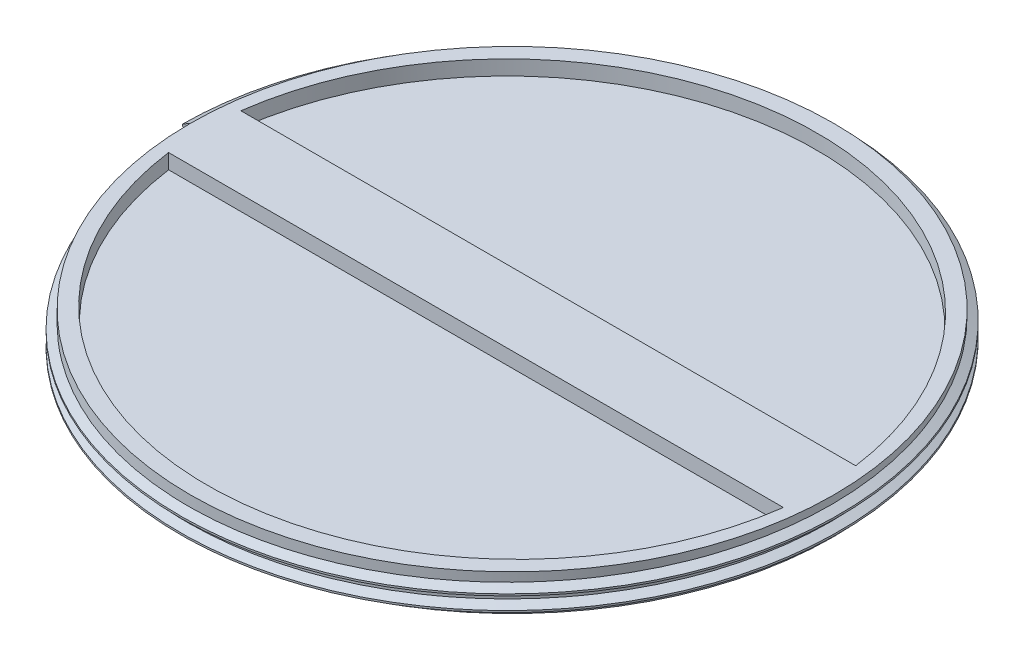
ISO-10303-21;
HEADER;
FILE_DESCRIPTION(('STEP AP214'),'2;1');
FILE_NAME('part.step','',(''),(''),'','','');
FILE_SCHEMA(('AUTOMOTIVE_DESIGN { 1 0 10303 214 1 1 1 1 }'));
ENDSEC;
DATA;
#1=APPLICATION_CONTEXT('core data for automotive mechanical design processes');
#2=APPLICATION_PROTOCOL_DEFINITION('international standard','automotive_design',2000,#1);
#3=PRODUCT_CONTEXT('',#1,'mechanical');
#4=PRODUCT('Part','Part','',(#3));
#5=PRODUCT_RELATED_PRODUCT_CATEGORY('part','',(#4));
#6=PRODUCT_DEFINITION_FORMATION('','',#4);
#7=PRODUCT_DEFINITION_CONTEXT('part definition',#1,'design');
#8=PRODUCT_DEFINITION('design','',#6,#7);
#9=PRODUCT_DEFINITION_SHAPE('','',#8);
#10=(LENGTH_UNIT() NAMED_UNIT(*) SI_UNIT(.MILLI.,.METRE.));
#11=(NAMED_UNIT(*) PLANE_ANGLE_UNIT() SI_UNIT($,.RADIAN.));
#12=(NAMED_UNIT(*) SI_UNIT($,.STERADIAN.) SOLID_ANGLE_UNIT());
#13=UNCERTAINTY_MEASURE_WITH_UNIT(LENGTH_MEASURE(1.E-05),#10,'distance_accuracy_value','');
#14=(GEOMETRIC_REPRESENTATION_CONTEXT(3) GLOBAL_UNCERTAINTY_ASSIGNED_CONTEXT((#13)) GLOBAL_UNIT_ASSIGNED_CONTEXT((#10,
#11,#12)) REPRESENTATION_CONTEXT('',''));
#15=CARTESIAN_POINT('',(0.,0.,0.));
#16=DIRECTION('',(0.,0.,1.));
#17=DIRECTION('',(1.,0.,0.));
#18=AXIS2_PLACEMENT_3D('',#15,#16,#17);
#19=CARTESIAN_POINT('',(0.,5.,0.));
#20=DIRECTION('',(0.,1.,0.));
#21=DIRECTION('',(0.,0.,1.));
#22=AXIS2_PLACEMENT_3D('',#19,#20,#21);
#23=PLANE('',#22);
#24=CARTESIAN_POINT('',(0.,5.,-0.718918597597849));
#25=DIRECTION('',(0.,1.,0.));
#26=DIRECTION('',(0.,0.,1.));
#27=AXIS2_PLACEMENT_3D('',#24,#25,#26);
#28=CIRCLE('',#27,42.8989457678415);
#29=CARTESIAN_POINT('',(-42.5160383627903,5.,5.00000000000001));
#30=VERTEX_POINT('',#29);
#31=CARTESIAN_POINT('',(42.5160383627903,5.,5.));
#32=VERTEX_POINT('',#31);
#33=EDGE_CURVE('E59',#30,#32,#28,.T.);
#34=ORIENTED_EDGE('',*,*,#33,.F.);
#35=DIRECTION('',(-1.,0.,0.));
#36=VECTOR('',#35,1.);
#37=CARTESIAN_POINT('',(42.5160383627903,5.,5.));
#38=LINE('',#37,#36);
#39=EDGE_CURVE('E170',#32,#30,#38,.T.);
#40=ORIENTED_EDGE('',*,*,#39,.F.);
#41=EDGE_LOOP('',(#34,#40));
#42=FACE_BOUND('',#41,.T.);
#43=CARTESIAN_POINT('',(0.,5.,0.));
#44=DIRECTION('',(0.,1.,0.));
#45=DIRECTION('',(0.,0.,1.));
#46=AXIS2_PLACEMENT_3D('',#43,#44,#45);
#47=CIRCLE('',#46,44.5);
#48=CARTESIAN_POINT('',(-44.5,5.,0.));
#49=VERTEX_POINT('',#48);
#50=EDGE_CURVE('E11',#49,#49,#47,.T.);
#51=ORIENTED_EDGE('',*,*,#50,.T.);
#52=EDGE_LOOP('',(#51));
#53=FACE_BOUND('',#52,.T.);
#54=DIRECTION('',(-1.,0.,0.));
#55=VECTOR('',#54,1.);
#56=CARTESIAN_POINT('',(42.5160383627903,5.,-5.));
#57=LINE('',#56,#55);
#58=CARTESIAN_POINT('',(42.5160383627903,5.,-5.));
#59=VERTEX_POINT('',#58);
#60=CARTESIAN_POINT('',(-42.5160383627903,5.,-5.00000000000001));
#61=VERTEX_POINT('',#60);
#62=EDGE_CURVE('E109',#59,#61,#57,.T.);
#63=ORIENTED_EDGE('',*,*,#62,.T.);
#64=CARTESIAN_POINT('',(0.,5.,0.718918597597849));
#65=DIRECTION('',(0.,-1.,0.));
#66=DIRECTION('',(0.,0.,-1.));
#67=AXIS2_PLACEMENT_3D('',#64,#65,#66);
#68=CIRCLE('',#67,42.8989457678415);
#69=EDGE_CURVE('E51',#61,#59,#68,.T.);
#70=ORIENTED_EDGE('',*,*,#69,.T.);
#71=EDGE_LOOP('',(#63,#70));
#72=FACE_BOUND('',#71,.T.);
#73=ADVANCED_FACE('F36',(#42,#53,#72),#23,.T.);
#74=CARTESIAN_POINT('',(0.,5.,0.));
#75=DIRECTION('',(0.,-1.,0.));
#76=DIRECTION('',(0.,0.,-1.));
#77=AXIS2_PLACEMENT_3D('',#74,#75,#76);
#78=CYLINDRICAL_SURFACE('',#77,44.5);
#79=CARTESIAN_POINT('',(0.,0.,0.));
#80=DIRECTION('',(0.,1.,0.));
#81=DIRECTION('',(0.,0.,1.));
#82=AXIS2_PLACEMENT_3D('',#79,#80,#81);
#83=CIRCLE('',#82,44.5);
#84=CARTESIAN_POINT('',(-7.51145031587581E-07,0.,44.5));
#85=VERTEX_POINT('',#84);
#86=CARTESIAN_POINT('',(-44.5,0.,0.));
#87=VERTEX_POINT('',#86);
#88=EDGE_CURVE('E40',#85,#87,#83,.T.);
#89=ORIENTED_EDGE('',*,*,#88,.T.);
#90=DIRECTION('',(0.,-1.,0.));
#91=VECTOR('',#90,1.);
#92=CARTESIAN_POINT('',(-44.5,0.250000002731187,0.));
#93=LINE('',#92,#91);
#94=CARTESIAN_POINT('',(-44.5,1.,0.));
#95=VERTEX_POINT('',#94);
#96=EDGE_CURVE('E223',#95,#87,#93,.T.);
#97=ORIENTED_EDGE('',*,*,#96,.F.);
#98=CARTESIAN_POINT('',(-44.5,5.,0.));
#99=CARTESIAN_POINT('',(-44.5,4.9,-14.4589264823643));
#100=CARTESIAN_POINT('',(-36.0012562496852,4.8,-26.1564437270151));
#101=CARTESIAN_POINT('',(-27.5025124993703,4.7,-37.8539609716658));
#102=CARTESIAN_POINT('',(-13.7512562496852,4.6,-42.3220149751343));
#103=CARTESIAN_POINT('',(0.,4.5,-46.7900689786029));
#104=CARTESIAN_POINT('',(13.7512562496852,4.4,-42.3220149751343));
#105=CARTESIAN_POINT('',(27.5025124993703,4.3,-37.8539609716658));
#106=CARTESIAN_POINT('',(36.0012562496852,4.2,-26.1564437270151));
#107=CARTESIAN_POINT('',(44.5,4.1,-14.4589264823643));
#108=CARTESIAN_POINT('',(44.5,4.,0.));
#109=CARTESIAN_POINT('',(44.5,3.9,14.4589264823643));
#110=CARTESIAN_POINT('',(36.0012562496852,3.8,26.1564437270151));
#111=CARTESIAN_POINT('',(27.5025124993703,3.7,37.8539609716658));
#112=CARTESIAN_POINT('',(13.7512562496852,3.6,42.3220149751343));
#113=CARTESIAN_POINT('',(0.,3.5,46.7900689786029));
#114=CARTESIAN_POINT('',(-13.7512562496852,3.4,42.3220149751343));
#115=CARTESIAN_POINT('',(-27.5025124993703,3.3,37.8539609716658));
#116=CARTESIAN_POINT('',(-36.0012562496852,3.2,26.1564437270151));
#117=CARTESIAN_POINT('',(-44.5,3.1,14.4589264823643));
#118=CARTESIAN_POINT('',(-44.5,3.,0.));
#119=CARTESIAN_POINT('',(-44.5,2.9,-14.4589264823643));
#120=CARTESIAN_POINT('',(-36.0012562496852,2.8,-26.1564437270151));
#121=CARTESIAN_POINT('',(-27.5025124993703,2.7,-37.8539609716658));
#122=CARTESIAN_POINT('',(-13.7512562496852,2.6,-42.3220149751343));
#123=CARTESIAN_POINT('',(0.,2.5,-46.7900689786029));
#124=CARTESIAN_POINT('',(13.7512562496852,2.4,-42.3220149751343));
#125=CARTESIAN_POINT('',(27.5025124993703,2.3,-37.8539609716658));
#126=CARTESIAN_POINT('',(36.0012562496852,2.2,-26.1564437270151));
#127=CARTESIAN_POINT('',(44.5,2.1,-14.4589264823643));
#128=CARTESIAN_POINT('',(44.5,2.,0.));
#129=CARTESIAN_POINT('',(44.5,1.9,14.4589264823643));
#130=CARTESIAN_POINT('',(36.0012562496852,1.8,26.1564437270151));
#131=CARTESIAN_POINT('',(27.5025124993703,1.7,37.8539609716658));
#132=CARTESIAN_POINT('',(13.7512562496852,1.6,42.3220149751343));
#133=CARTESIAN_POINT('',(0.,1.5,46.7900689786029));
#134=CARTESIAN_POINT('',(-13.7512562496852,1.4,42.3220149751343));
#135=CARTESIAN_POINT('',(-27.5025124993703,1.3,37.8539609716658));
#136=CARTESIAN_POINT('',(-36.0012562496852,1.2,26.1564437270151));
#137=CARTESIAN_POINT('',(-44.5,1.1,14.4589264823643));
#138=CARTESIAN_POINT('',(-44.5,1.,0.));
#139=(BOUNDED_CURVE() B_SPLINE_CURVE(2,(#98,#99,#100,#101,#102,#103,#104,#105,#106,#107,#108,
#109,#110,#111,#112,#113,#114,#115,#116,#117,#118,#119,#120,#121,#122,#123,#124,#125,#126,#127,
#128,#129,#130,#131,#132,#133,#134,#135,#136,#137,#138),.UNSPECIFIED.,.F.,
.F.) B_SPLINE_CURVE_WITH_KNOTS((3,2,2,2,2,2,2,2,2,2,2,2,2,2,2,2,2,2,2,2,3),(0.,0.05,0.1,0.15,
0.2,0.25,0.3,0.35,0.4,0.45,0.5,0.55,0.6,0.65,0.7,0.75,0.8,0.85,0.9,0.95,1.),
.UNSPECIFIED.) CURVE() GEOMETRIC_REPRESENTATION_ITEM() RATIONAL_B_SPLINE_CURVE((1.,
0.951056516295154,1.,0.951056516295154,1.,0.951056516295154,1.,0.951056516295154,1.,
0.951056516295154,1.,0.951056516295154,1.,0.951056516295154,1.,0.951056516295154,1.,
0.951056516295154,1.,0.951056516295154,1.,0.951056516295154,1.,0.951056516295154,1.,
0.951056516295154,1.,0.951056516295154,1.,0.951056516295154,1.,0.951056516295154,1.,
0.951056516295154,1.,0.951056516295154,1.,0.951056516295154,1.,0.951056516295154,1.)) REPRESENTATION_ITEM(''));
#140=EDGE_CURVE('E189',#49,#95,#139,.T.);
#141=ORIENTED_EDGE('',*,*,#140,.F.);
#142=ORIENTED_EDGE('',*,*,#50,.F.);
#143=DIRECTION('',(0.,1.,0.));
#144=VECTOR('',#143,1.);
#145=CARTESIAN_POINT('',(-44.5,4.25000000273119,0.));
#146=LINE('',#145,#144);
#147=CARTESIAN_POINT('',(-44.5,3.50000000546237,0.));
#148=VERTEX_POINT('',#147);
#149=EDGE_CURVE('E188',#148,#49,#146,.T.);
#150=ORIENTED_EDGE('',*,*,#149,.F.);
#151=CARTESIAN_POINT('',(-44.5,3.50000000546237,0.));
#152=CARTESIAN_POINT('',(-44.5,3.40000000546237,-14.4589264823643));
#153=CARTESIAN_POINT('',(-36.0012562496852,3.30000000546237,-26.1564437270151));
#154=CARTESIAN_POINT('',(-27.5025124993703,3.20000000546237,-37.8539609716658));
#155=CARTESIAN_POINT('',(-13.7512562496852,3.10000000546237,-42.3220149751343));
#156=CARTESIAN_POINT('',(0.,3.00000000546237,-46.7900689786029));
#157=CARTESIAN_POINT('',(13.7512562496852,2.90000000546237,-42.3220149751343));
#158=CARTESIAN_POINT('',(27.5025124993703,2.80000000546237,-37.8539609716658));
#159=CARTESIAN_POINT('',(36.0012562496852,2.70000000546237,-26.1564437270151));
#160=CARTESIAN_POINT('',(44.5,2.60000000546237,-14.4589264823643));
#161=CARTESIAN_POINT('',(44.5,2.50000000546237,0.));
#162=CARTESIAN_POINT('',(44.5,2.40000000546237,14.4589264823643));
#163=CARTESIAN_POINT('',(36.0012562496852,2.30000000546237,26.1564437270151));
#164=CARTESIAN_POINT('',(27.5025124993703,2.20000000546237,37.8539609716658));
#165=CARTESIAN_POINT('',(13.7512562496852,2.10000000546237,42.3220149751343));
#166=CARTESIAN_POINT('',(0.,2.00000000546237,46.7900689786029));
#167=CARTESIAN_POINT('',(-13.7512562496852,1.90000000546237,42.3220149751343));
#168=CARTESIAN_POINT('',(-27.5025124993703,1.80000000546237,37.8539609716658));
#169=CARTESIAN_POINT('',(-36.0012562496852,1.70000000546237,26.1564437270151));
#170=CARTESIAN_POINT('',(-44.5,1.60000000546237,14.4589264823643));
#171=CARTESIAN_POINT('',(-44.5,1.50000000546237,0.));
#172=CARTESIAN_POINT('',(-44.5,1.40000000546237,-14.4589264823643));
#173=CARTESIAN_POINT('',(-36.0012562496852,1.30000000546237,-26.1564437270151));
#174=CARTESIAN_POINT('',(-27.5025124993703,1.20000000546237,-37.8539609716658));
#175=CARTESIAN_POINT('',(-13.7512562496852,1.10000000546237,-42.3220149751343));
#176=CARTESIAN_POINT('',(0.,1.00000000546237,-46.7900689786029));
#177=CARTESIAN_POINT('',(13.7512562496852,0.900000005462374,-42.3220149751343));
#178=CARTESIAN_POINT('',(27.5025124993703,0.800000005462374,-37.8539609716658));
#179=CARTESIAN_POINT('',(36.0012562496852,0.700000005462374,-26.1564437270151));
#180=CARTESIAN_POINT('',(44.5,0.600000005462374,-14.4589264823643));
#181=CARTESIAN_POINT('',(44.5,0.500000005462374,0.));
#182=CARTESIAN_POINT('',(44.5,0.400000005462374,14.4589264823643));
#183=CARTESIAN_POINT('',(36.0012562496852,0.300000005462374,26.1564437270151));
#184=CARTESIAN_POINT('',(27.5025124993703,0.200000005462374,37.8539609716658));
#185=CARTESIAN_POINT('',(13.7512562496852,0.100000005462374,42.3220149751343));
#186=CARTESIAN_POINT('',(0.,5.46237404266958E-09,46.7900689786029));
#187=CARTESIAN_POINT('',(-13.7512562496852,-0.0999999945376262,42.3220149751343));
#188=CARTESIAN_POINT('',(-27.5025124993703,-0.199999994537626,37.8539609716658));
#189=CARTESIAN_POINT('',(-36.0012562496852,-0.299999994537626,26.1564437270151));
#190=CARTESIAN_POINT('',(-44.5,-0.399999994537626,14.4589264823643));
#191=CARTESIAN_POINT('',(-44.5,-0.499999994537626,0.));
#192=(BOUNDED_CURVE() B_SPLINE_CURVE(2,(#151,#152,#153,#154,#155,#156,#157,#158,#159,#160,#161,
#162,#163,#164,#165,#166,#167,#168,#169,#170,#171,#172,#173,#174,#175,#176,#177,#178,#179,#180,
#181,#182,#183,#184,#185,#186,#187,#188,#189,#190,#191),.UNSPECIFIED.,.F.,
.F.) B_SPLINE_CURVE_WITH_KNOTS((3,2,2,2,2,2,2,2,2,2,2,2,2,2,2,2,2,2,2,2,3),(0.,0.05,0.1,0.15,
0.2,0.25,0.3,0.35,0.4,0.45,0.5,0.55,0.6,0.65,0.7,0.75,0.8,0.85,0.9,0.95,1.),
.UNSPECIFIED.) CURVE() GEOMETRIC_REPRESENTATION_ITEM() RATIONAL_B_SPLINE_CURVE((1.,
0.951056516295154,1.,0.951056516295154,1.,0.951056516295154,1.,0.951056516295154,1.,
0.951056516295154,1.,0.951056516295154,1.,0.951056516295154,1.,0.951056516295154,1.,
0.951056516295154,1.,0.951056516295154,1.,0.951056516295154,1.,0.951056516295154,1.,
0.951056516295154,1.,0.951056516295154,1.,0.951056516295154,1.,0.951056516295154,1.,
0.951056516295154,1.,0.951056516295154,1.,0.951056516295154,1.,0.951056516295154,1.)) REPRESENTATION_ITEM(''));
#193=EDGE_CURVE('E173',#148,#85,#192,.T.);
#194=ORIENTED_EDGE('',*,*,#193,.T.);
#195=EDGE_LOOP('',(#89,#97,#141,#142,#150,#194));
#196=FACE_BOUND('',#195,.T.);
#197=ADVANCED_FACE('F38',(#196),#78,.T.);
#198=CARTESIAN_POINT('',(0.,0.,0.));
#199=DIRECTION('',(0.,1.,0.));
#200=DIRECTION('',(0.,0.,1.));
#201=AXIS2_PLACEMENT_3D('',#198,#199,#200);
#202=PLANE('',#201);
#203=ORIENTED_EDGE('',*,*,#88,.F.);
#204=EDGE_CURVE('E216',#87,#85,#83,.T.);
#205=ORIENTED_EDGE('',*,*,#204,.F.);
#206=EDGE_LOOP('',(#203,#205));
#207=FACE_BOUND('',#206,.T.);
#208=ADVANCED_FACE('F256',(#207),#202,.F.);
#209=CARTESIAN_POINT('',(0.,5.,0.));
#210=DIRECTION('',(0.,-1.,0.));
#211=DIRECTION('',(0.,0.,-1.));
#212=AXIS2_PLACEMENT_3D('',#209,#210,#211);
#213=CYLINDRICAL_SURFACE('',#212,44.5);
#214=ORIENTED_EDGE('',*,*,#204,.T.);
#215=CARTESIAN_POINT('',(-44.5,-0.499999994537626,0.));
#216=VERTEX_POINT('',#215);
#217=EDGE_CURVE('E179',#85,#216,#192,.T.);
#218=ORIENTED_EDGE('',*,*,#217,.T.);
#219=EDGE_CURVE('E198',#87,#216,#93,.T.);
#220=ORIENTED_EDGE('',*,*,#219,.F.);
#221=EDGE_LOOP('',(#214,#218,#220));
#222=FACE_BOUND('',#221,.T.);
#223=ADVANCED_FACE('F259',(#222),#213,.F.);
#224=CARTESIAN_POINT('',(-45.58253175,4.25000000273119,0.));
#225=DIRECTION('',(0.,0.,1.));
#226=DIRECTION('',(1.,0.,0.));
#227=AXIS2_PLACEMENT_3D('',#224,#225,#226);
#228=PLANE('',#227);
#229=DIRECTION('',(0.,-1.,0.));
#230=VECTOR('',#229,1.);
#231=CARTESIAN_POINT('',(-45.58253175,4.25000000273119,0.));
#232=LINE('',#231,#230);
#233=CARTESIAN_POINT('',(-45.58253175,4.37500000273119,0.));
#234=VERTEX_POINT('',#233);
#235=CARTESIAN_POINT('',(-45.58253175,4.12500000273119,0.));
#236=VERTEX_POINT('',#235);
#237=EDGE_CURVE('E217',#234,#236,#232,.T.);
#238=ORIENTED_EDGE('',*,*,#237,.T.);
#239=DIRECTION('',(0.866025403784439,-0.499999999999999,0.));
#240=VECTOR('',#239,1.);
#241=CARTESIAN_POINT('',(-45.041265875,3.81250000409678,0.));
#242=LINE('',#241,#240);
#243=EDGE_CURVE('E230',#236,#148,#242,.T.);
#244=ORIENTED_EDGE('',*,*,#243,.T.);
#245=ORIENTED_EDGE('',*,*,#149,.T.);
#246=DIRECTION('',(-0.866025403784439,-0.499999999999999,0.));
#247=VECTOR('',#246,1.);
#248=CARTESIAN_POINT('',(-45.041265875,4.68750000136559,0.));
#249=LINE('',#248,#247);
#250=EDGE_CURVE('E208',#49,#234,#249,.T.);
#251=ORIENTED_EDGE('',*,*,#250,.T.);
#252=EDGE_LOOP('',(#238,#244,#245,#251));
#253=FACE_BOUND('',#252,.T.);
#254=ADVANCED_FACE('F266',(#253),#228,.T.);
#255=CARTESIAN_POINT('',(-45.58253175,0.250000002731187,0.));
#256=DIRECTION('',(0.,0.,-1.));
#257=DIRECTION('',(-1.,0.,0.));
#258=AXIS2_PLACEMENT_3D('',#255,#256,#257);
#259=PLANE('',#258);
#260=DIRECTION('',(0.,1.,0.));
#261=VECTOR('',#260,1.);
#262=CARTESIAN_POINT('',(-45.58253175,0.250000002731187,0.));
#263=LINE('',#262,#261);
#264=CARTESIAN_POINT('',(-45.58253175,0.125000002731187,0.));
#265=VERTEX_POINT('',#264);
#266=CARTESIAN_POINT('',(-45.58253175,0.375000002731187,0.));
#267=VERTEX_POINT('',#266);
#268=EDGE_CURVE('E209',#265,#267,#263,.T.);
#269=ORIENTED_EDGE('',*,*,#268,.T.);
#270=DIRECTION('',(0.866025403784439,0.499999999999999,0.));
#271=VECTOR('',#270,1.);
#272=CARTESIAN_POINT('',(-45.041265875,0.687500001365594,0.));
#273=LINE('',#272,#271);
#274=EDGE_CURVE('E207',#267,#95,#273,.T.);
#275=ORIENTED_EDGE('',*,*,#274,.T.);
#276=ORIENTED_EDGE('',*,*,#96,.T.);
#277=ORIENTED_EDGE('',*,*,#219,.T.);
#278=DIRECTION('',(-0.866025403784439,0.499999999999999,0.));
#279=VECTOR('',#278,1.);
#280=CARTESIAN_POINT('',(-45.041265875,-0.18749999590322,0.));
#281=LINE('',#280,#279);
#282=EDGE_CURVE('E228',#216,#265,#281,.T.);
#283=ORIENTED_EDGE('',*,*,#282,.T.);
#284=EDGE_LOOP('',(#269,#275,#276,#277,#283));
#285=FACE_BOUND('',#284,.T.);
#286=ADVANCED_FACE('F280',(#285),#259,.T.);
#287=CARTESIAN_POINT('',(-45.58253175,4.37500000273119,0.));
#288=CARTESIAN_POINT('',(-45.58253175,4.27500000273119,-14.8106623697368));
#289=CARTESIAN_POINT('',(-36.8770428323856,4.17500000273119,-26.7927399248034));
#290=CARTESIAN_POINT('',(-28.1715539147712,4.07500000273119,-38.77481747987));
#291=CARTESIAN_POINT('',(-14.0857769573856,3.97500000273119,-43.3515638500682));
#292=CARTESIAN_POINT('',(0.,3.87500000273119,-47.9283102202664));
#293=CARTESIAN_POINT('',(14.0857769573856,3.77500000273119,-43.3515638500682));
#294=CARTESIAN_POINT('',(28.1715539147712,3.67500000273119,-38.77481747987));
#295=CARTESIAN_POINT('',(36.8770428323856,3.57500000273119,-26.7927399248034));
#296=CARTESIAN_POINT('',(45.58253175,3.47500000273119,-14.8106623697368));
#297=CARTESIAN_POINT('',(45.58253175,3.37500000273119,0.));
#298=CARTESIAN_POINT('',(45.58253175,3.27500000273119,14.8106623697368));
#299=CARTESIAN_POINT('',(36.8770428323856,3.17500000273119,26.7927399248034));
#300=CARTESIAN_POINT('',(28.1715539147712,3.07500000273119,38.77481747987));
#301=CARTESIAN_POINT('',(14.0857769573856,2.97500000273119,43.3515638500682));
#302=CARTESIAN_POINT('',(0.,2.87500000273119,47.9283102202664));
#303=CARTESIAN_POINT('',(-14.0857769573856,2.77500000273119,43.3515638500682));
#304=CARTESIAN_POINT('',(-28.1715539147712,2.67500000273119,38.77481747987));
#305=CARTESIAN_POINT('',(-36.8770428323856,2.57500000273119,26.7927399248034));
#306=CARTESIAN_POINT('',(-45.58253175,2.47500000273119,14.8106623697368));
#307=CARTESIAN_POINT('',(-45.58253175,2.37500000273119,0.));
#308=CARTESIAN_POINT('',(-45.58253175,2.27500000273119,-14.8106623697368));
#309=CARTESIAN_POINT('',(-36.8770428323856,2.17500000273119,-26.7927399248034));
#310=CARTESIAN_POINT('',(-28.1715539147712,2.07500000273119,-38.77481747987));
#311=CARTESIAN_POINT('',(-14.0857769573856,1.97500000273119,-43.3515638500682));
#312=CARTESIAN_POINT('',(0.,1.87500000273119,-47.9283102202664));
#313=CARTESIAN_POINT('',(14.0857769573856,1.77500000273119,-43.3515638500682));
#314=CARTESIAN_POINT('',(28.1715539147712,1.67500000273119,-38.77481747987));
#315=CARTESIAN_POINT('',(36.8770428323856,1.57500000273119,-26.7927399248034));
#316=CARTESIAN_POINT('',(45.58253175,1.47500000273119,-14.8106623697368));
#317=CARTESIAN_POINT('',(45.58253175,1.37500000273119,0.));
#318=CARTESIAN_POINT('',(45.58253175,1.27500000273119,14.8106623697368));
#319=CARTESIAN_POINT('',(36.8770428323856,1.17500000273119,26.7927399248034));
#320=CARTESIAN_POINT('',(28.1715539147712,1.07500000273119,38.77481747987));
#321=CARTESIAN_POINT('',(14.0857769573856,0.975000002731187,43.3515638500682));
#322=CARTESIAN_POINT('',(0.,0.875000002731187,47.9283102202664));
#323=CARTESIAN_POINT('',(-14.0857769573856,0.775000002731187,43.3515638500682));
#324=CARTESIAN_POINT('',(-28.1715539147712,0.675000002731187,38.77481747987));
#325=CARTESIAN_POINT('',(-36.8770428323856,0.575000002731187,26.7927399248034));
#326=CARTESIAN_POINT('',(-45.58253175,0.475000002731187,14.8106623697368));
#327=CARTESIAN_POINT('',(-45.58253175,0.375000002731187,0.));
#328=CARTESIAN_POINT('',(-45.58253175,4.12500000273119,0.));
#329=CARTESIAN_POINT('',(-45.58253175,4.02500000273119,-14.8106623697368));
#330=CARTESIAN_POINT('',(-36.8770428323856,3.92500000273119,-26.7927399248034));
#331=CARTESIAN_POINT('',(-28.1715539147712,3.82500000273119,-38.77481747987));
#332=CARTESIAN_POINT('',(-14.0857769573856,3.72500000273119,-43.3515638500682));
#333=CARTESIAN_POINT('',(0.,3.62500000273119,-47.9283102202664));
#334=CARTESIAN_POINT('',(14.0857769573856,3.52500000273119,-43.3515638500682));
#335=CARTESIAN_POINT('',(28.1715539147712,3.42500000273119,-38.77481747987));
#336=CARTESIAN_POINT('',(36.8770428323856,3.32500000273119,-26.7927399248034));
#337=CARTESIAN_POINT('',(45.58253175,3.22500000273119,-14.8106623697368));
#338=CARTESIAN_POINT('',(45.58253175,3.12500000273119,0.));
#339=CARTESIAN_POINT('',(45.58253175,3.02500000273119,14.8106623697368));
#340=CARTESIAN_POINT('',(36.8770428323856,2.92500000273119,26.7927399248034));
#341=CARTESIAN_POINT('',(28.1715539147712,2.82500000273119,38.77481747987));
#342=CARTESIAN_POINT('',(14.0857769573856,2.72500000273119,43.3515638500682));
#343=CARTESIAN_POINT('',(0.,2.62500000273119,47.9283102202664));
#344=CARTESIAN_POINT('',(-14.0857769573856,2.52500000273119,43.3515638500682));
#345=CARTESIAN_POINT('',(-28.1715539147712,2.42500000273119,38.77481747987));
#346=CARTESIAN_POINT('',(-36.8770428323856,2.32500000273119,26.7927399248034));
#347=CARTESIAN_POINT('',(-45.58253175,2.22500000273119,14.8106623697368));
#348=CARTESIAN_POINT('',(-45.58253175,2.12500000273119,0.));
#349=CARTESIAN_POINT('',(-45.58253175,2.02500000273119,-14.8106623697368));
#350=CARTESIAN_POINT('',(-36.8770428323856,1.92500000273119,-26.7927399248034));
#351=CARTESIAN_POINT('',(-28.1715539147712,1.82500000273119,-38.77481747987));
#352=CARTESIAN_POINT('',(-14.0857769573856,1.72500000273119,-43.3515638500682));
#353=CARTESIAN_POINT('',(0.,1.62500000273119,-47.9283102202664));
#354=CARTESIAN_POINT('',(14.0857769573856,1.52500000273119,-43.3515638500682));
#355=CARTESIAN_POINT('',(28.1715539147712,1.42500000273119,-38.77481747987));
#356=CARTESIAN_POINT('',(36.8770428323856,1.32500000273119,-26.7927399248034));
#357=CARTESIAN_POINT('',(45.58253175,1.22500000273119,-14.8106623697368));
#358=CARTESIAN_POINT('',(45.58253175,1.12500000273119,0.));
#359=CARTESIAN_POINT('',(45.58253175,1.02500000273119,14.8106623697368));
#360=CARTESIAN_POINT('',(36.8770428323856,0.925000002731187,26.7927399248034));
#361=CARTESIAN_POINT('',(28.1715539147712,0.825000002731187,38.77481747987));
#362=CARTESIAN_POINT('',(14.0857769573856,0.725000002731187,43.3515638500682));
#363=CARTESIAN_POINT('',(0.,0.625000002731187,47.9283102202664));
#364=CARTESIAN_POINT('',(-14.0857769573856,0.525000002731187,43.3515638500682));
#365=CARTESIAN_POINT('',(-28.1715539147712,0.425000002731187,38.77481747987));
#366=CARTESIAN_POINT('',(-36.8770428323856,0.325000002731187,26.7927399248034));
#367=CARTESIAN_POINT('',(-45.58253175,0.225000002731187,14.8106623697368));
#368=CARTESIAN_POINT('',(-45.58253175,0.125000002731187,0.));
#369=(BOUNDED_SURFACE() B_SPLINE_SURFACE(1,2,((#287,#288,#289,#290,#291,#292,#293,#294,#295,
#296,#297,#298,#299,#300,#301,#302,#303,#304,#305,#306,#307,#308,#309,#310,#311,#312,#313,#314,
#315,#316,#317,#318,#319,#320,#321,#322,#323,#324,#325,#326,#327),(#328,#329,#330,#331,#332,
#333,#334,#335,#336,#337,#338,#339,#340,#341,#342,#343,#344,#345,#346,#347,#348,#349,#350,#351,
#352,#353,#354,#355,#356,#357,#358,#359,#360,#361,#362,#363,#364,#365,#366,#367,#368)),
.UNSPECIFIED.,.F.,.F.,.F.) B_SPLINE_SURFACE_WITH_KNOTS((2,2),(3,2,2,2,2,2,2,2,2,2,2,2,2,2,2,2,2,
2,2,2,3),(0.,1.),(0.,0.05,0.1,0.15,0.2,0.25,0.3,0.35,0.4,0.45,0.5,0.55,0.6,0.65,0.7,0.75,0.8,
0.85,0.9,0.95,1.),.UNSPECIFIED.) GEOMETRIC_REPRESENTATION_ITEM() RATIONAL_B_SPLINE_SURFACE(((1.,
0.951056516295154,1.,0.951056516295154,1.,0.951056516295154,1.,0.951056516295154,1.,
0.951056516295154,1.,0.951056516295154,1.,0.951056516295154,1.,0.951056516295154,1.,
0.951056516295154,1.,0.951056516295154,1.,0.951056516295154,1.,0.951056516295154,1.,
0.951056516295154,1.,0.951056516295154,1.,0.951056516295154,1.,0.951056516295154,1.,
0.951056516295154,1.,0.951056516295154,1.,0.951056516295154,1.,0.951056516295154,1.),(1.,
0.951056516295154,1.,0.951056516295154,1.,0.951056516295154,1.,0.951056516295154,1.,
0.951056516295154,1.,0.951056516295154,1.,0.951056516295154,1.,0.951056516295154,1.,
0.951056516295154,1.,0.951056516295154,1.,0.951056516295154,1.,0.951056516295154,1.,
0.951056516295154,1.,0.951056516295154,1.,0.951056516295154,1.,0.951056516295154,1.,
0.951056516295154,1.,0.951056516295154,1.,0.951056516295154,1.,0.951056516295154,1.))) REPRESENTATION_ITEM('') SURFACE());
#370=CARTESIAN_POINT('',(-45.58253175,4.37500000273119,0.));
#371=CARTESIAN_POINT('',(-45.58253175,4.27500000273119,-14.8106623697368));
#372=CARTESIAN_POINT('',(-36.8770428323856,4.17500000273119,-26.7927399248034));
#373=CARTESIAN_POINT('',(-28.1715539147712,4.07500000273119,-38.77481747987));
#374=CARTESIAN_POINT('',(-14.0857769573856,3.97500000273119,-43.3515638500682));
#375=CARTESIAN_POINT('',(0.,3.87500000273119,-47.9283102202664));
#376=CARTESIAN_POINT('',(14.0857769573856,3.77500000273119,-43.3515638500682));
#377=CARTESIAN_POINT('',(28.1715539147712,3.67500000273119,-38.77481747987));
#378=CARTESIAN_POINT('',(36.8770428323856,3.57500000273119,-26.7927399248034));
#379=CARTESIAN_POINT('',(45.58253175,3.47500000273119,-14.8106623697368));
#380=CARTESIAN_POINT('',(45.58253175,3.37500000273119,0.));
#381=CARTESIAN_POINT('',(45.58253175,3.27500000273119,14.8106623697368));
#382=CARTESIAN_POINT('',(36.8770428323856,3.17500000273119,26.7927399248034));
#383=CARTESIAN_POINT('',(28.1715539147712,3.07500000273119,38.77481747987));
#384=CARTESIAN_POINT('',(14.0857769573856,2.97500000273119,43.3515638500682));
#385=CARTESIAN_POINT('',(0.,2.87500000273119,47.9283102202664));
#386=CARTESIAN_POINT('',(-14.0857769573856,2.77500000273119,43.3515638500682));
#387=CARTESIAN_POINT('',(-28.1715539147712,2.67500000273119,38.77481747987));
#388=CARTESIAN_POINT('',(-36.8770428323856,2.57500000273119,26.7927399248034));
#389=CARTESIAN_POINT('',(-45.58253175,2.47500000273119,14.8106623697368));
#390=CARTESIAN_POINT('',(-45.58253175,2.37500000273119,0.));
#391=CARTESIAN_POINT('',(-45.58253175,2.27500000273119,-14.8106623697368));
#392=CARTESIAN_POINT('',(-36.8770428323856,2.17500000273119,-26.7927399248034));
#393=CARTESIAN_POINT('',(-28.1715539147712,2.07500000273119,-38.77481747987));
#394=CARTESIAN_POINT('',(-14.0857769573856,1.97500000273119,-43.3515638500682));
#395=CARTESIAN_POINT('',(0.,1.87500000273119,-47.9283102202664));
#396=CARTESIAN_POINT('',(14.0857769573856,1.77500000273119,-43.3515638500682));
#397=CARTESIAN_POINT('',(28.1715539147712,1.67500000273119,-38.77481747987));
#398=CARTESIAN_POINT('',(36.8770428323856,1.57500000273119,-26.7927399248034));
#399=CARTESIAN_POINT('',(45.58253175,1.47500000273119,-14.8106623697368));
#400=CARTESIAN_POINT('',(45.58253175,1.37500000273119,0.));
#401=CARTESIAN_POINT('',(45.58253175,1.27500000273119,14.8106623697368));
#402=CARTESIAN_POINT('',(36.8770428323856,1.17500000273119,26.7927399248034));
#403=CARTESIAN_POINT('',(28.1715539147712,1.07500000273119,38.77481747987));
#404=CARTESIAN_POINT('',(14.0857769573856,0.975000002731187,43.3515638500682));
#405=CARTESIAN_POINT('',(0.,0.875000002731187,47.9283102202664));
#406=CARTESIAN_POINT('',(-14.0857769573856,0.775000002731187,43.3515638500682));
#407=CARTESIAN_POINT('',(-28.1715539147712,0.675000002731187,38.77481747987));
#408=CARTESIAN_POINT('',(-36.8770428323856,0.575000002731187,26.7927399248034));
#409=CARTESIAN_POINT('',(-45.58253175,0.475000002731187,14.8106623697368));
#410=CARTESIAN_POINT('',(-45.58253175,0.375000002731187,0.));
#411=(BOUNDED_CURVE() B_SPLINE_CURVE(2,(#370,#371,#372,#373,#374,#375,#376,#377,#378,#379,#380,
#381,#382,#383,#384,#385,#386,#387,#388,#389,#390,#391,#392,#393,#394,#395,#396,#397,#398,#399,
#400,#401,#402,#403,#404,#405,#406,#407,#408,#409,#410),.UNSPECIFIED.,.F.,
.F.) B_SPLINE_CURVE_WITH_KNOTS((3,2,2,2,2,2,2,2,2,2,2,2,2,2,2,2,2,2,2,2,3),(0.,0.05,0.1,0.15,
0.2,0.25,0.3,0.35,0.4,0.45,0.5,0.55,0.6,0.65,0.7,0.75,0.8,0.85,0.9,0.95,1.),
.UNSPECIFIED.) CURVE() GEOMETRIC_REPRESENTATION_ITEM() RATIONAL_B_SPLINE_CURVE((1.,
0.951056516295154,1.,0.951056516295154,1.,0.951056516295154,1.,0.951056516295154,1.,
0.951056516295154,1.,0.951056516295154,1.,0.951056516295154,1.,0.951056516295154,1.,
0.951056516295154,1.,0.951056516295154,1.,0.951056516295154,1.,0.951056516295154,1.,
0.951056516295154,1.,0.951056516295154,1.,0.951056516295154,1.,0.951056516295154,1.,
0.951056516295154,1.,0.951056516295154,1.,0.951056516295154,1.,0.951056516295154,1.)) REPRESENTATION_ITEM(''));
#412=EDGE_CURVE('E199',#234,#267,#411,.T.);
#413=CARTESIAN_POINT('',(-45.58253175,4.12500000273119,0.));
#414=CARTESIAN_POINT('',(-45.58253175,4.02500000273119,-14.8106623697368));
#415=CARTESIAN_POINT('',(-36.8770428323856,3.92500000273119,-26.7927399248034));
#416=CARTESIAN_POINT('',(-28.1715539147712,3.82500000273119,-38.77481747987));
#417=CARTESIAN_POINT('',(-14.0857769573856,3.72500000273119,-43.3515638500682));
#418=CARTESIAN_POINT('',(0.,3.62500000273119,-47.9283102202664));
#419=CARTESIAN_POINT('',(14.0857769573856,3.52500000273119,-43.3515638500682));
#420=CARTESIAN_POINT('',(28.1715539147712,3.42500000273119,-38.77481747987));
#421=CARTESIAN_POINT('',(36.8770428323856,3.32500000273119,-26.7927399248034));
#422=CARTESIAN_POINT('',(45.58253175,3.22500000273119,-14.8106623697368));
#423=CARTESIAN_POINT('',(45.58253175,3.12500000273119,0.));
#424=CARTESIAN_POINT('',(45.58253175,3.02500000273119,14.8106623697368));
#425=CARTESIAN_POINT('',(36.8770428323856,2.92500000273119,26.7927399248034));
#426=CARTESIAN_POINT('',(28.1715539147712,2.82500000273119,38.77481747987));
#427=CARTESIAN_POINT('',(14.0857769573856,2.72500000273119,43.3515638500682));
#428=CARTESIAN_POINT('',(0.,2.62500000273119,47.9283102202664));
#429=CARTESIAN_POINT('',(-14.0857769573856,2.52500000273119,43.3515638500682));
#430=CARTESIAN_POINT('',(-28.1715539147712,2.42500000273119,38.77481747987));
#431=CARTESIAN_POINT('',(-36.8770428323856,2.32500000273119,26.7927399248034));
#432=CARTESIAN_POINT('',(-45.58253175,2.22500000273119,14.8106623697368));
#433=CARTESIAN_POINT('',(-45.58253175,2.12500000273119,0.));
#434=CARTESIAN_POINT('',(-45.58253175,2.02500000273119,-14.8106623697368));
#435=CARTESIAN_POINT('',(-36.8770428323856,1.92500000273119,-26.7927399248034));
#436=CARTESIAN_POINT('',(-28.1715539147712,1.82500000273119,-38.77481747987));
#437=CARTESIAN_POINT('',(-14.0857769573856,1.72500000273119,-43.3515638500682));
#438=CARTESIAN_POINT('',(0.,1.62500000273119,-47.9283102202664));
#439=CARTESIAN_POINT('',(14.0857769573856,1.52500000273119,-43.3515638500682));
#440=CARTESIAN_POINT('',(28.1715539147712,1.42500000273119,-38.77481747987));
#441=CARTESIAN_POINT('',(36.8770428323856,1.32500000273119,-26.7927399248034));
#442=CARTESIAN_POINT('',(45.58253175,1.22500000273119,-14.8106623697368));
#443=CARTESIAN_POINT('',(45.58253175,1.12500000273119,0.));
#444=CARTESIAN_POINT('',(45.58253175,1.02500000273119,14.8106623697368));
#445=CARTESIAN_POINT('',(36.8770428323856,0.925000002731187,26.7927399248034));
#446=CARTESIAN_POINT('',(28.1715539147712,0.825000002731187,38.77481747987));
#447=CARTESIAN_POINT('',(14.0857769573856,0.725000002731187,43.3515638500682));
#448=CARTESIAN_POINT('',(0.,0.625000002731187,47.9283102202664));
#449=CARTESIAN_POINT('',(-14.0857769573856,0.525000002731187,43.3515638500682));
#450=CARTESIAN_POINT('',(-28.1715539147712,0.425000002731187,38.77481747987));
#451=CARTESIAN_POINT('',(-36.8770428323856,0.325000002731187,26.7927399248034));
#452=CARTESIAN_POINT('',(-45.58253175,0.225000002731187,14.8106623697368));
#453=CARTESIAN_POINT('',(-45.58253175,0.125000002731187,0.));
#454=(BOUNDED_CURVE() B_SPLINE_CURVE(2,(#413,#414,#415,#416,#417,#418,#419,#420,#421,#422,#423,
#424,#425,#426,#427,#428,#429,#430,#431,#432,#433,#434,#435,#436,#437,#438,#439,#440,#441,#442,
#443,#444,#445,#446,#447,#448,#449,#450,#451,#452,#453),.UNSPECIFIED.,.F.,
.F.) B_SPLINE_CURVE_WITH_KNOTS((3,2,2,2,2,2,2,2,2,2,2,2,2,2,2,2,2,2,2,2,3),(0.,0.05,0.1,0.15,
0.2,0.25,0.3,0.35,0.4,0.45,0.5,0.55,0.6,0.65,0.7,0.75,0.8,0.85,0.9,0.95,1.),
.UNSPECIFIED.) CURVE() GEOMETRIC_REPRESENTATION_ITEM() RATIONAL_B_SPLINE_CURVE((1.,
0.951056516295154,1.,0.951056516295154,1.,0.951056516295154,1.,0.951056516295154,1.,
0.951056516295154,1.,0.951056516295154,1.,0.951056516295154,1.,0.951056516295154,1.,
0.951056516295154,1.,0.951056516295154,1.,0.951056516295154,1.,0.951056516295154,1.,
0.951056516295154,1.,0.951056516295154,1.,0.951056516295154,1.,0.951056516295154,1.,
0.951056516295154,1.,0.951056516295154,1.,0.951056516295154,1.,0.951056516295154,1.)) REPRESENTATION_ITEM(''));
#455=EDGE_CURVE('E178',#236,#265,#454,.T.);
#456=ORIENTED_EDGE('',*,*,#237,.F.);
#457=ORIENTED_EDGE('',*,*,#412,.T.);
#458=ORIENTED_EDGE('',*,*,#268,.F.);
#459=ORIENTED_EDGE('',*,*,#455,.F.);
#460=EDGE_LOOP('',(#456,#457,#458,#459));
#461=FACE_BOUND('',#460,.T.);
#462=ADVANCED_FACE('F288',(#461),#369,.F.);
#463=CARTESIAN_POINT('',(-44.5,5.,0.));
#464=CARTESIAN_POINT('',(-44.5,4.9,-14.4589264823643));
#465=CARTESIAN_POINT('',(-36.0012562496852,4.8,-26.1564437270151));
#466=CARTESIAN_POINT('',(-27.5025124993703,4.7,-37.8539609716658));
#467=CARTESIAN_POINT('',(-13.7512562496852,4.6,-42.3220149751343));
#468=CARTESIAN_POINT('',(0.,4.5,-46.7900689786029));
#469=CARTESIAN_POINT('',(13.7512562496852,4.4,-42.3220149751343));
#470=CARTESIAN_POINT('',(27.5025124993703,4.3,-37.8539609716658));
#471=CARTESIAN_POINT('',(36.0012562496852,4.2,-26.1564437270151));
#472=CARTESIAN_POINT('',(44.5,4.1,-14.4589264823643));
#473=CARTESIAN_POINT('',(44.5,4.,0.));
#474=CARTESIAN_POINT('',(44.5,3.9,14.4589264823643));
#475=CARTESIAN_POINT('',(36.0012562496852,3.8,26.1564437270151));
#476=CARTESIAN_POINT('',(27.5025124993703,3.7,37.8539609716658));
#477=CARTESIAN_POINT('',(13.7512562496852,3.6,42.3220149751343));
#478=CARTESIAN_POINT('',(0.,3.5,46.7900689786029));
#479=CARTESIAN_POINT('',(-13.7512562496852,3.4,42.3220149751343));
#480=CARTESIAN_POINT('',(-27.5025124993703,3.3,37.8539609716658));
#481=CARTESIAN_POINT('',(-36.0012562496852,3.2,26.1564437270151));
#482=CARTESIAN_POINT('',(-44.5,3.1,14.4589264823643));
#483=CARTESIAN_POINT('',(-44.5,3.,0.));
#484=CARTESIAN_POINT('',(-44.5,2.9,-14.4589264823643));
#485=CARTESIAN_POINT('',(-36.0012562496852,2.8,-26.1564437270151));
#486=CARTESIAN_POINT('',(-27.5025124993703,2.7,-37.8539609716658));
#487=CARTESIAN_POINT('',(-13.7512562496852,2.6,-42.3220149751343));
#488=CARTESIAN_POINT('',(0.,2.5,-46.7900689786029));
#489=CARTESIAN_POINT('',(13.7512562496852,2.4,-42.3220149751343));
#490=CARTESIAN_POINT('',(27.5025124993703,2.3,-37.8539609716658));
#491=CARTESIAN_POINT('',(36.0012562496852,2.2,-26.1564437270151));
#492=CARTESIAN_POINT('',(44.5,2.1,-14.4589264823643));
#493=CARTESIAN_POINT('',(44.5,2.,0.));
#494=CARTESIAN_POINT('',(44.5,1.9,14.4589264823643));
#495=CARTESIAN_POINT('',(36.0012562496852,1.8,26.1564437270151));
#496=CARTESIAN_POINT('',(27.5025124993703,1.7,37.8539609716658));
#497=CARTESIAN_POINT('',(13.7512562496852,1.6,42.3220149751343));
#498=CARTESIAN_POINT('',(0.,1.5,46.7900689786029));
#499=CARTESIAN_POINT('',(-13.7512562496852,1.4,42.3220149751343));
#500=CARTESIAN_POINT('',(-27.5025124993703,1.3,37.8539609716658));
#501=CARTESIAN_POINT('',(-36.0012562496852,1.2,26.1564437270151));
#502=CARTESIAN_POINT('',(-44.5,1.1,14.4589264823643));
#503=CARTESIAN_POINT('',(-44.5,1.,0.));
#504=CARTESIAN_POINT('',(-45.58253175,4.37500000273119,0.));
#505=CARTESIAN_POINT('',(-45.58253175,4.27500000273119,-14.8106623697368));
#506=CARTESIAN_POINT('',(-36.8770428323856,4.17500000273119,-26.7927399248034));
#507=CARTESIAN_POINT('',(-28.1715539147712,4.07500000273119,-38.77481747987));
#508=CARTESIAN_POINT('',(-14.0857769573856,3.97500000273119,-43.3515638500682));
#509=CARTESIAN_POINT('',(0.,3.87500000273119,-47.9283102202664));
#510=CARTESIAN_POINT('',(14.0857769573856,3.77500000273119,-43.3515638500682));
#511=CARTESIAN_POINT('',(28.1715539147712,3.67500000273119,-38.77481747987));
#512=CARTESIAN_POINT('',(36.8770428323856,3.57500000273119,-26.7927399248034));
#513=CARTESIAN_POINT('',(45.58253175,3.47500000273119,-14.8106623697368));
#514=CARTESIAN_POINT('',(45.58253175,3.37500000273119,0.));
#515=CARTESIAN_POINT('',(45.58253175,3.27500000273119,14.8106623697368));
#516=CARTESIAN_POINT('',(36.8770428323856,3.17500000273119,26.7927399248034));
#517=CARTESIAN_POINT('',(28.1715539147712,3.07500000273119,38.77481747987));
#518=CARTESIAN_POINT('',(14.0857769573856,2.97500000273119,43.3515638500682));
#519=CARTESIAN_POINT('',(0.,2.87500000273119,47.9283102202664));
#520=CARTESIAN_POINT('',(-14.0857769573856,2.77500000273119,43.3515638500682));
#521=CARTESIAN_POINT('',(-28.1715539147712,2.67500000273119,38.77481747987));
#522=CARTESIAN_POINT('',(-36.8770428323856,2.57500000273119,26.7927399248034));
#523=CARTESIAN_POINT('',(-45.58253175,2.47500000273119,14.8106623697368));
#524=CARTESIAN_POINT('',(-45.58253175,2.37500000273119,0.));
#525=CARTESIAN_POINT('',(-45.58253175,2.27500000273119,-14.8106623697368));
#526=CARTESIAN_POINT('',(-36.8770428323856,2.17500000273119,-26.7927399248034));
#527=CARTESIAN_POINT('',(-28.1715539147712,2.07500000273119,-38.77481747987));
#528=CARTESIAN_POINT('',(-14.0857769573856,1.97500000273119,-43.3515638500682));
#529=CARTESIAN_POINT('',(0.,1.87500000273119,-47.9283102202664));
#530=CARTESIAN_POINT('',(14.0857769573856,1.77500000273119,-43.3515638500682));
#531=CARTESIAN_POINT('',(28.1715539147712,1.67500000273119,-38.77481747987));
#532=CARTESIAN_POINT('',(36.8770428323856,1.57500000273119,-26.7927399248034));
#533=CARTESIAN_POINT('',(45.58253175,1.47500000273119,-14.8106623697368));
#534=CARTESIAN_POINT('',(45.58253175,1.37500000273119,0.));
#535=CARTESIAN_POINT('',(45.58253175,1.27500000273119,14.8106623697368));
#536=CARTESIAN_POINT('',(36.8770428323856,1.17500000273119,26.7927399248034));
#537=CARTESIAN_POINT('',(28.1715539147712,1.07500000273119,38.77481747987));
#538=CARTESIAN_POINT('',(14.0857769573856,0.975000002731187,43.3515638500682));
#539=CARTESIAN_POINT('',(0.,0.875000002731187,47.9283102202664));
#540=CARTESIAN_POINT('',(-14.0857769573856,0.775000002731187,43.3515638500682));
#541=CARTESIAN_POINT('',(-28.1715539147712,0.675000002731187,38.77481747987));
#542=CARTESIAN_POINT('',(-36.8770428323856,0.575000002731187,26.7927399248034));
#543=CARTESIAN_POINT('',(-45.58253175,0.475000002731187,14.8106623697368));
#544=CARTESIAN_POINT('',(-45.58253175,0.375000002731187,0.));
#545=(BOUNDED_SURFACE() B_SPLINE_SURFACE(1,2,((#463,#464,#465,#466,#467,#468,#469,#470,#471,
#472,#473,#474,#475,#476,#477,#478,#479,#480,#481,#482,#483,#484,#485,#486,#487,#488,#489,#490,
#491,#492,#493,#494,#495,#496,#497,#498,#499,#500,#501,#502,#503),(#504,#505,#506,#507,#508,
#509,#510,#511,#512,#513,#514,#515,#516,#517,#518,#519,#520,#521,#522,#523,#524,#525,#526,#527,
#528,#529,#530,#531,#532,#533,#534,#535,#536,#537,#538,#539,#540,#541,#542,#543,#544)),
.UNSPECIFIED.,.F.,.F.,.F.) B_SPLINE_SURFACE_WITH_KNOTS((2,2),(3,2,2,2,2,2,2,2,2,2,2,2,2,2,2,2,2,
2,2,2,3),(0.,1.),(0.,0.05,0.1,0.15,0.2,0.25,0.3,0.35,0.4,0.45,0.5,0.55,0.6,0.65,0.7,0.75,0.8,
0.85,0.9,0.95,1.),.UNSPECIFIED.) GEOMETRIC_REPRESENTATION_ITEM() RATIONAL_B_SPLINE_SURFACE(((1.,
0.951056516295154,1.,0.951056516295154,1.,0.951056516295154,1.,0.951056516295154,1.,
0.951056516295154,1.,0.951056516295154,1.,0.951056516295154,1.,0.951056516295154,1.,
0.951056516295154,1.,0.951056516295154,1.,0.951056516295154,1.,0.951056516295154,1.,
0.951056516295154,1.,0.951056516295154,1.,0.951056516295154,1.,0.951056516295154,1.,
0.951056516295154,1.,0.951056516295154,1.,0.951056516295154,1.,0.951056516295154,1.),(1.,
0.951056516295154,1.,0.951056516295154,1.,0.951056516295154,1.,0.951056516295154,1.,
0.951056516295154,1.,0.951056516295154,1.,0.951056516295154,1.,0.951056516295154,1.,
0.951056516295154,1.,0.951056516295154,1.,0.951056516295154,1.,0.951056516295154,1.,
0.951056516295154,1.,0.951056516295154,1.,0.951056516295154,1.,0.951056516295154,1.,
0.951056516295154,1.,0.951056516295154,1.,0.951056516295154,1.,0.951056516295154,1.))) REPRESENTATION_ITEM('') SURFACE());
#546=ORIENTED_EDGE('',*,*,#250,.F.);
#547=ORIENTED_EDGE('',*,*,#140,.T.);
#548=ORIENTED_EDGE('',*,*,#274,.F.);
#549=ORIENTED_EDGE('',*,*,#412,.F.);
#550=EDGE_LOOP('',(#546,#547,#548,#549));
#551=FACE_BOUND('',#550,.T.);
#552=ADVANCED_FACE('F284',(#551),#545,.F.);
#553=CARTESIAN_POINT('',(-45.58253175,4.12500000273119,0.));
#554=CARTESIAN_POINT('',(-45.58253175,4.02500000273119,-14.8106623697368));
#555=CARTESIAN_POINT('',(-36.8770428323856,3.92500000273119,-26.7927399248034));
#556=CARTESIAN_POINT('',(-28.1715539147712,3.82500000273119,-38.77481747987));
#557=CARTESIAN_POINT('',(-14.0857769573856,3.72500000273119,-43.3515638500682));
#558=CARTESIAN_POINT('',(0.,3.62500000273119,-47.9283102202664));
#559=CARTESIAN_POINT('',(14.0857769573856,3.52500000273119,-43.3515638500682));
#560=CARTESIAN_POINT('',(28.1715539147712,3.42500000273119,-38.77481747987));
#561=CARTESIAN_POINT('',(36.8770428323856,3.32500000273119,-26.7927399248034));
#562=CARTESIAN_POINT('',(45.58253175,3.22500000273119,-14.8106623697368));
#563=CARTESIAN_POINT('',(45.58253175,3.12500000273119,0.));
#564=CARTESIAN_POINT('',(45.58253175,3.02500000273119,14.8106623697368));
#565=CARTESIAN_POINT('',(36.8770428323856,2.92500000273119,26.7927399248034));
#566=CARTESIAN_POINT('',(28.1715539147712,2.82500000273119,38.77481747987));
#567=CARTESIAN_POINT('',(14.0857769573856,2.72500000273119,43.3515638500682));
#568=CARTESIAN_POINT('',(0.,2.62500000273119,47.9283102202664));
#569=CARTESIAN_POINT('',(-14.0857769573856,2.52500000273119,43.3515638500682));
#570=CARTESIAN_POINT('',(-28.1715539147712,2.42500000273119,38.77481747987));
#571=CARTESIAN_POINT('',(-36.8770428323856,2.32500000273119,26.7927399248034));
#572=CARTESIAN_POINT('',(-45.58253175,2.22500000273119,14.8106623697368));
#573=CARTESIAN_POINT('',(-45.58253175,2.12500000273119,0.));
#574=CARTESIAN_POINT('',(-45.58253175,2.02500000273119,-14.8106623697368));
#575=CARTESIAN_POINT('',(-36.8770428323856,1.92500000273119,-26.7927399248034));
#576=CARTESIAN_POINT('',(-28.1715539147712,1.82500000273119,-38.77481747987));
#577=CARTESIAN_POINT('',(-14.0857769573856,1.72500000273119,-43.3515638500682));
#578=CARTESIAN_POINT('',(0.,1.62500000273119,-47.9283102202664));
#579=CARTESIAN_POINT('',(14.0857769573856,1.52500000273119,-43.3515638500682));
#580=CARTESIAN_POINT('',(28.1715539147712,1.42500000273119,-38.77481747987));
#581=CARTESIAN_POINT('',(36.8770428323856,1.32500000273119,-26.7927399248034));
#582=CARTESIAN_POINT('',(45.58253175,1.22500000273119,-14.8106623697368));
#583=CARTESIAN_POINT('',(45.58253175,1.12500000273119,0.));
#584=CARTESIAN_POINT('',(45.58253175,1.02500000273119,14.8106623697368));
#585=CARTESIAN_POINT('',(36.8770428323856,0.925000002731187,26.7927399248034));
#586=CARTESIAN_POINT('',(28.1715539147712,0.825000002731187,38.77481747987));
#587=CARTESIAN_POINT('',(14.0857769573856,0.725000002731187,43.3515638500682));
#588=CARTESIAN_POINT('',(0.,0.625000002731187,47.9283102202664));
#589=CARTESIAN_POINT('',(-14.0857769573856,0.525000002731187,43.3515638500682));
#590=CARTESIAN_POINT('',(-28.1715539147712,0.425000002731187,38.77481747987));
#591=CARTESIAN_POINT('',(-36.8770428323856,0.325000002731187,26.7927399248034));
#592=CARTESIAN_POINT('',(-45.58253175,0.225000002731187,14.8106623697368));
#593=CARTESIAN_POINT('',(-45.58253175,0.125000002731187,0.));
#594=CARTESIAN_POINT('',(-44.5,3.50000000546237,0.));
#595=CARTESIAN_POINT('',(-44.5,3.40000000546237,-14.4589264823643));
#596=CARTESIAN_POINT('',(-36.0012562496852,3.30000000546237,-26.1564437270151));
#597=CARTESIAN_POINT('',(-27.5025124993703,3.20000000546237,-37.8539609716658));
#598=CARTESIAN_POINT('',(-13.7512562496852,3.10000000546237,-42.3220149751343));
#599=CARTESIAN_POINT('',(0.,3.00000000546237,-46.7900689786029));
#600=CARTESIAN_POINT('',(13.7512562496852,2.90000000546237,-42.3220149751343));
#601=CARTESIAN_POINT('',(27.5025124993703,2.80000000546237,-37.8539609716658));
#602=CARTESIAN_POINT('',(36.0012562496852,2.70000000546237,-26.1564437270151));
#603=CARTESIAN_POINT('',(44.5,2.60000000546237,-14.4589264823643));
#604=CARTESIAN_POINT('',(44.5,2.50000000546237,0.));
#605=CARTESIAN_POINT('',(44.5,2.40000000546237,14.4589264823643));
#606=CARTESIAN_POINT('',(36.0012562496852,2.30000000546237,26.1564437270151));
#607=CARTESIAN_POINT('',(27.5025124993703,2.20000000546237,37.8539609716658));
#608=CARTESIAN_POINT('',(13.7512562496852,2.10000000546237,42.3220149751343));
#609=CARTESIAN_POINT('',(0.,2.00000000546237,46.7900689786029));
#610=CARTESIAN_POINT('',(-13.7512562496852,1.90000000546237,42.3220149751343));
#611=CARTESIAN_POINT('',(-27.5025124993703,1.80000000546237,37.8539609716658));
#612=CARTESIAN_POINT('',(-36.0012562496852,1.70000000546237,26.1564437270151));
#613=CARTESIAN_POINT('',(-44.5,1.60000000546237,14.4589264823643));
#614=CARTESIAN_POINT('',(-44.5,1.50000000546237,0.));
#615=CARTESIAN_POINT('',(-44.5,1.40000000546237,-14.4589264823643));
#616=CARTESIAN_POINT('',(-36.0012562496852,1.30000000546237,-26.1564437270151));
#617=CARTESIAN_POINT('',(-27.5025124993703,1.20000000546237,-37.8539609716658));
#618=CARTESIAN_POINT('',(-13.7512562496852,1.10000000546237,-42.3220149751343));
#619=CARTESIAN_POINT('',(0.,1.00000000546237,-46.7900689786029));
#620=CARTESIAN_POINT('',(13.7512562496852,0.900000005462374,-42.3220149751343));
#621=CARTESIAN_POINT('',(27.5025124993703,0.800000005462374,-37.8539609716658));
#622=CARTESIAN_POINT('',(36.0012562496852,0.700000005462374,-26.1564437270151));
#623=CARTESIAN_POINT('',(44.5,0.600000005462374,-14.4589264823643));
#624=CARTESIAN_POINT('',(44.5,0.500000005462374,0.));
#625=CARTESIAN_POINT('',(44.5,0.400000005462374,14.4589264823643));
#626=CARTESIAN_POINT('',(36.0012562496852,0.300000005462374,26.1564437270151));
#627=CARTESIAN_POINT('',(27.5025124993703,0.200000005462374,37.8539609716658));
#628=CARTESIAN_POINT('',(13.7512562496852,0.100000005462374,42.3220149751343));
#629=CARTESIAN_POINT('',(0.,5.46237404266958E-09,46.7900689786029));
#630=CARTESIAN_POINT('',(-13.7512562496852,-0.0999999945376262,42.3220149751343));
#631=CARTESIAN_POINT('',(-27.5025124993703,-0.199999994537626,37.8539609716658));
#632=CARTESIAN_POINT('',(-36.0012562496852,-0.299999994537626,26.1564437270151));
#633=CARTESIAN_POINT('',(-44.5,-0.399999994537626,14.4589264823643));
#634=CARTESIAN_POINT('',(-44.5,-0.499999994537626,0.));
#635=(BOUNDED_SURFACE() B_SPLINE_SURFACE(1,2,((#553,#554,#555,#556,#557,#558,#559,#560,#561,
#562,#563,#564,#565,#566,#567,#568,#569,#570,#571,#572,#573,#574,#575,#576,#577,#578,#579,#580,
#581,#582,#583,#584,#585,#586,#587,#588,#589,#590,#591,#592,#593),(#594,#595,#596,#597,#598,
#599,#600,#601,#602,#603,#604,#605,#606,#607,#608,#609,#610,#611,#612,#613,#614,#615,#616,#617,
#618,#619,#620,#621,#622,#623,#624,#625,#626,#627,#628,#629,#630,#631,#632,#633,#634)),
.UNSPECIFIED.,.F.,.F.,.F.) B_SPLINE_SURFACE_WITH_KNOTS((2,2),(3,2,2,2,2,2,2,2,2,2,2,2,2,2,2,2,2,
2,2,2,3),(0.,1.),(0.,0.05,0.1,0.15,0.2,0.25,0.3,0.35,0.4,0.45,0.5,0.55,0.6,0.65,0.7,0.75,0.8,
0.85,0.9,0.95,1.),.UNSPECIFIED.) GEOMETRIC_REPRESENTATION_ITEM() RATIONAL_B_SPLINE_SURFACE(((1.,
0.951056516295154,1.,0.951056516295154,1.,0.951056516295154,1.,0.951056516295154,1.,
0.951056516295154,1.,0.951056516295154,1.,0.951056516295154,1.,0.951056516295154,1.,
0.951056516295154,1.,0.951056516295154,1.,0.951056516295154,1.,0.951056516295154,1.,
0.951056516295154,1.,0.951056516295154,1.,0.951056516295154,1.,0.951056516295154,1.,
0.951056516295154,1.,0.951056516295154,1.,0.951056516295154,1.,0.951056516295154,1.),(1.,
0.951056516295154,1.,0.951056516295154,1.,0.951056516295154,1.,0.951056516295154,1.,
0.951056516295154,1.,0.951056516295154,1.,0.951056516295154,1.,0.951056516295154,1.,
0.951056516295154,1.,0.951056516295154,1.,0.951056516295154,1.,0.951056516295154,1.,
0.951056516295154,1.,0.951056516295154,1.,0.951056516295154,1.,0.951056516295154,1.,
0.951056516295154,1.,0.951056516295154,1.,0.951056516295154,1.,0.951056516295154,1.))) REPRESENTATION_ITEM('') SURFACE());
#636=ORIENTED_EDGE('',*,*,#243,.F.);
#637=ORIENTED_EDGE('',*,*,#455,.T.);
#638=ORIENTED_EDGE('',*,*,#282,.F.);
#639=ORIENTED_EDGE('',*,*,#217,.F.);
#640=ORIENTED_EDGE('',*,*,#193,.F.);
#641=EDGE_LOOP('',(#636,#637,#638,#639,#640));
#642=FACE_BOUND('',#641,.T.);
#643=ADVANCED_FACE('F276',(#642),#635,.F.);
#644=CARTESIAN_POINT('',(0.,5.,-0.718918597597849));
#645=DIRECTION('',(0.,1.,0.));
#646=DIRECTION('',(0.,0.,1.));
#647=AXIS2_PLACEMENT_3D('',#644,#645,#646);
#648=CONICAL_SURFACE('',#647,42.8989457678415,0.0349065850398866);
#649=ORIENTED_EDGE('',*,*,#33,.T.);
#650=CARTESIAN_POINT('',(42.4360981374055,3.,5.06984153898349));
#651=CARTESIAN_POINT('',(42.4494340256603,3.33333283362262,5.05820129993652));
#652=CARTESIAN_POINT('',(42.4627636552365,3.66666591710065,5.04656105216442));
#653=CARTESIAN_POINT('',(42.4894103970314,4.33333258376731,5.02328053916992));
#654=CARTESIAN_POINT('',(42.5027275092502,4.66666616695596,5.01164027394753));
#655=CARTESIAN_POINT('',(42.5160383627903,5.,5.));
#656=B_SPLINE_CURVE_WITH_KNOTS('',3,(#650,#651,#652,#653,#654,#655),.UNSPECIFIED.,.F.,.F.,(4,2,
4),(0.,1.00140754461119,2.00281508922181),.UNSPECIFIED.);
#657=CARTESIAN_POINT('',(42.4360981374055,3.,5.06984153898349));
#658=VERTEX_POINT('',#657);
#659=EDGE_CURVE('E160',#658,#32,#656,.T.);
#660=ORIENTED_EDGE('',*,*,#659,.F.);
#661=CARTESIAN_POINT('',(0.,3.,-0.718918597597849));
#662=DIRECTION('',(0.,1.,0.));
#663=DIRECTION('',(0.,0.,1.));
#664=AXIS2_PLACEMENT_3D('',#661,#662,#663);
#665=CIRCLE('',#664,42.829104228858);
#666=CARTESIAN_POINT('',(-42.4360981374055,3.,5.0698415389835));
#667=VERTEX_POINT('',#666);
#668=EDGE_CURVE('E167',#667,#658,#665,.T.);
#669=ORIENTED_EDGE('',*,*,#668,.F.);
#670=CARTESIAN_POINT('',(-42.4360981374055,3.,5.0698415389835));
#671=CARTESIAN_POINT('',(-42.4494340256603,3.33333283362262,5.05820129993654));
#672=CARTESIAN_POINT('',(-42.4627636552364,3.66666591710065,5.04656105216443));
#673=CARTESIAN_POINT('',(-42.4894103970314,4.33333258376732,5.02328053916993));
#674=CARTESIAN_POINT('',(-42.5027275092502,4.66666616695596,5.01164027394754));
#675=CARTESIAN_POINT('',(-42.5160383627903,5.,5.00000000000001));
#676=B_SPLINE_CURVE_WITH_KNOTS('',3,(#670,#671,#672,#673,#674,#675),.UNSPECIFIED.,.F.,.F.,(4,2,
4),(0.,1.00140754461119,2.00281508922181),.UNSPECIFIED.);
#677=EDGE_CURVE('E153',#667,#30,#676,.T.);
#678=ORIENTED_EDGE('',*,*,#677,.T.);
#679=EDGE_LOOP('',(#649,#660,#669,#678));
#680=FACE_BOUND('',#679,.T.);
#681=ADVANCED_FACE('F147',(#680),#648,.F.);
#682=CARTESIAN_POINT('',(42.5160383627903,5.,5.));
#683=DIRECTION('',(0.,-0.034899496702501,-0.999390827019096));
#684=DIRECTION('',(0.,0.999390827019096,-0.034899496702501));
#685=AXIS2_PLACEMENT_3D('',#682,#683,#684);
#686=PLANE('',#685);
#687=ORIENTED_EDGE('',*,*,#39,.T.);
#688=ORIENTED_EDGE('',*,*,#677,.F.);
#689=DIRECTION('',(-1.,0.,0.));
#690=VECTOR('',#689,1.);
#691=CARTESIAN_POINT('',(0.,3.,5.0698415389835));
#692=LINE('',#691,#690);
#693=EDGE_CURVE('E166',#658,#667,#692,.T.);
#694=ORIENTED_EDGE('',*,*,#693,.F.);
#695=ORIENTED_EDGE('',*,*,#659,.T.);
#696=EDGE_LOOP('',(#687,#688,#694,#695));
#697=FACE_BOUND('',#696,.T.);
#698=ADVANCED_FACE('F142',(#697),#686,.F.);
#699=CARTESIAN_POINT('',(0.,3.,-0.718918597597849));
#700=DIRECTION('',(0.,1.,0.));
#701=DIRECTION('',(0.,0.,1.));
#702=AXIS2_PLACEMENT_3D('',#699,#700,#701);
#703=PLANE('',#702);
#704=ORIENTED_EDGE('',*,*,#668,.T.);
#705=ORIENTED_EDGE('',*,*,#693,.T.);
#706=EDGE_LOOP('',(#704,#705));
#707=FACE_BOUND('',#706,.T.);
#708=ADVANCED_FACE('F138',(#707),#703,.T.);
#709=CARTESIAN_POINT('',(0.,5.,0.718918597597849));
#710=DIRECTION('',(0.,1.,0.));
#711=DIRECTION('',(0.,0.,-1.));
#712=AXIS2_PLACEMENT_3D('',#709,#710,#711);
#713=CONICAL_SURFACE('',#712,42.8989457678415,0.0349065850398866);
#714=ORIENTED_EDGE('',*,*,#69,.F.);
#715=CARTESIAN_POINT('',(-42.4360981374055,3.,-5.0698415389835));
#716=CARTESIAN_POINT('',(-42.4494340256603,3.33333283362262,-5.05820129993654));
#717=CARTESIAN_POINT('',(-42.4627636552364,3.66666591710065,-5.04656105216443));
#718=CARTESIAN_POINT('',(-42.4894103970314,4.33333258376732,-5.02328053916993));
#719=CARTESIAN_POINT('',(-42.5027275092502,4.66666616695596,-5.01164027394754));
#720=CARTESIAN_POINT('',(-42.5160383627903,5.,-5.00000000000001));
#721=B_SPLINE_CURVE_WITH_KNOTS('',3,(#715,#716,#717,#718,#719,#720),.UNSPECIFIED.,.F.,.F.,(4,2,
4),(0.,1.00140754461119,2.00281508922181),.UNSPECIFIED.);
#722=CARTESIAN_POINT('',(-42.4360981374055,3.,-5.0698415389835));
#723=VERTEX_POINT('',#722);
#724=EDGE_CURVE('E112',#723,#61,#721,.T.);
#725=ORIENTED_EDGE('',*,*,#724,.F.);
#726=CARTESIAN_POINT('',(0.,3.,0.718918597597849));
#727=DIRECTION('',(0.,1.,0.));
#728=DIRECTION('',(0.,0.,1.));
#729=AXIS2_PLACEMENT_3D('',#726,#727,#728);
#730=CIRCLE('',#729,42.829104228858);
#731=CARTESIAN_POINT('',(42.4360981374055,3.,-5.06984153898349));
#732=VERTEX_POINT('',#731);
#733=EDGE_CURVE('E114',#723,#732,#730,.F.);
#734=ORIENTED_EDGE('',*,*,#733,.T.);
#735=CARTESIAN_POINT('',(42.4360981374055,3.,-5.06984153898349));
#736=CARTESIAN_POINT('',(42.4494340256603,3.33333283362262,-5.05820129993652));
#737=CARTESIAN_POINT('',(42.4627636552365,3.66666591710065,-5.04656105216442));
#738=CARTESIAN_POINT('',(42.4894103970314,4.33333258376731,-5.02328053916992));
#739=CARTESIAN_POINT('',(42.5027275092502,4.66666616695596,-5.01164027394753));
#740=CARTESIAN_POINT('',(42.5160383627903,5.,-5.));
#741=B_SPLINE_CURVE_WITH_KNOTS('',3,(#735,#736,#737,#738,#739,#740),.UNSPECIFIED.,.F.,.F.,(4,2,
4),(0.,1.00140754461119,2.00281508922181),.UNSPECIFIED.);
#742=EDGE_CURVE('E111',#732,#59,#741,.T.);
#743=ORIENTED_EDGE('',*,*,#742,.T.);
#744=EDGE_LOOP('',(#714,#725,#734,#743));
#745=FACE_BOUND('',#744,.T.);
#746=ADVANCED_FACE('F117',(#745),#713,.F.);
#747=CARTESIAN_POINT('',(42.5160383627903,5.,-5.));
#748=DIRECTION('',(0.,-0.034899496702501,0.999390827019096));
#749=DIRECTION('',(0.,-0.999390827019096,-0.034899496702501));
#750=AXIS2_PLACEMENT_3D('',#747,#748,#749);
#751=PLANE('',#750);
#752=ORIENTED_EDGE('',*,*,#62,.F.);
#753=ORIENTED_EDGE('',*,*,#742,.F.);
#754=DIRECTION('',(1.,0.,0.));
#755=VECTOR('',#754,1.);
#756=CARTESIAN_POINT('',(0.,3.,-5.0698415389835));
#757=LINE('',#756,#755);
#758=EDGE_CURVE('E242',#732,#723,#757,.F.);
#759=ORIENTED_EDGE('',*,*,#758,.T.);
#760=ORIENTED_EDGE('',*,*,#724,.T.);
#761=EDGE_LOOP('',(#752,#753,#759,#760));
#762=FACE_BOUND('',#761,.T.);
#763=ADVANCED_FACE('F110',(#762),#751,.F.);
#764=CARTESIAN_POINT('',(0.,3.,0.718918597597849));
#765=DIRECTION('',(0.,1.,0.));
#766=DIRECTION('',(0.,0.,-1.));
#767=AXIS2_PLACEMENT_3D('',#764,#765,#766);
#768=PLANE('',#767);
#769=ORIENTED_EDGE('',*,*,#733,.F.);
#770=ORIENTED_EDGE('',*,*,#758,.F.);
#771=EDGE_LOOP('',(#769,#770));
#772=FACE_BOUND('',#771,.T.);
#773=ADVANCED_FACE('F244',(#772),#768,.T.);
#774=CLOSED_SHELL('',(#73,#197,#208,#223,#254,#286,#462,#552,#643,#681,#698,#708,#746,#763,#773));
#775=MANIFOLD_SOLID_BREP('B2',#774);
#776=ADVANCED_BREP_SHAPE_REPRESENTATION('',(#18,#775),#14);
#777=SHAPE_DEFINITION_REPRESENTATION(#9,#776);
ENDSEC;
END-ISO-10303-21;
